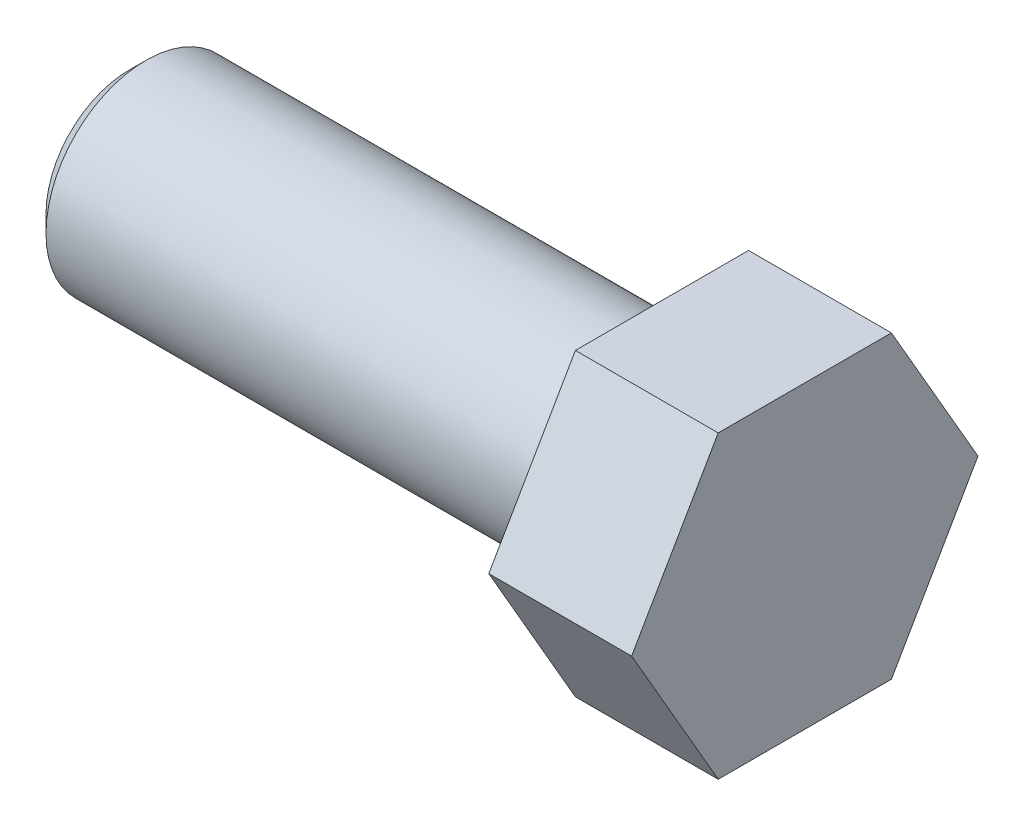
ISO-10303-21;
HEADER;
FILE_DESCRIPTION(('STEP AP214'),'2;1');
FILE_NAME('part.step','',(''),(''),'','','');
FILE_SCHEMA(('AUTOMOTIVE_DESIGN { 1 0 10303 214 1 1 1 1 }'));
ENDSEC;
DATA;
#1=APPLICATION_CONTEXT('core data for automotive mechanical design processes');
#2=APPLICATION_PROTOCOL_DEFINITION('international standard','automotive_design',2000,#1);
#3=PRODUCT_CONTEXT('',#1,'mechanical');
#4=PRODUCT('Part','Part','',(#3));
#5=PRODUCT_RELATED_PRODUCT_CATEGORY('part','',(#4));
#6=PRODUCT_DEFINITION_FORMATION('','',#4);
#7=PRODUCT_DEFINITION_CONTEXT('part definition',#1,'design');
#8=PRODUCT_DEFINITION('design','',#6,#7);
#9=PRODUCT_DEFINITION_SHAPE('','',#8);
#10=(LENGTH_UNIT() NAMED_UNIT(*) SI_UNIT(.MILLI.,.METRE.));
#11=(NAMED_UNIT(*) PLANE_ANGLE_UNIT() SI_UNIT($,.RADIAN.));
#12=(NAMED_UNIT(*) SI_UNIT($,.STERADIAN.) SOLID_ANGLE_UNIT());
#13=UNCERTAINTY_MEASURE_WITH_UNIT(LENGTH_MEASURE(1.E-05),#10,'distance_accuracy_value','');
#14=(GEOMETRIC_REPRESENTATION_CONTEXT(3) GLOBAL_UNCERTAINTY_ASSIGNED_CONTEXT((#13)) GLOBAL_UNIT_ASSIGNED_CONTEXT((#10,
#11,#12)) REPRESENTATION_CONTEXT('',''));
#15=CARTESIAN_POINT('',(0.,0.,0.));
#16=DIRECTION('',(0.,0.,1.));
#17=DIRECTION('',(1.,0.,0.));
#18=AXIS2_PLACEMENT_3D('',#15,#16,#17);
#19=CARTESIAN_POINT('',(-6.80720000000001,4.7625,0.));
#20=DIRECTION('',(1.,0.,0.));
#21=DIRECTION('',(0.,0.,-1.));
#22=AXIS2_PLACEMENT_3D('',#19,#20,#21);
#23=PLANE('',#22);
#24=CARTESIAN_POINT('',(-6.80720000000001,0.,0.));
#25=DIRECTION('',(-1.,0.,0.));
#26=DIRECTION('',(0.,0.,1.));
#27=AXIS2_PLACEMENT_3D('',#24,#25,#26);
#28=CIRCLE('',#27,4.7625);
#29=CARTESIAN_POINT('',(-6.80720000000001,0.,4.7625));
#30=VERTEX_POINT('',#29);
#31=EDGE_CURVE('E479',#30,#30,#28,.T.);
#32=ORIENTED_EDGE('',*,*,#31,.F.);
#33=EDGE_LOOP('',(#32));
#34=FACE_BOUND('',#33,.T.);
#35=DIRECTION('',(0.,-0.866025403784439,0.5));
#36=VECTOR('',#35,1.);
#37=CARTESIAN_POINT('',(-6.80720000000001,7.14639485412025,4.12902700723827));
#38=LINE('',#37,#36);
#39=CARTESIAN_POINT('',(-6.80720000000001,7.14903970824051,4.12749999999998));
#40=VERTEX_POINT('',#39);
#41=CARTESIAN_POINT('',(-6.80720000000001,0.,8.25499999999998));
#42=VERTEX_POINT('',#41);
#43=EDGE_CURVE('E12',#40,#42,#38,.T.);
#44=ORIENTED_EDGE('',*,*,#43,.F.);
#45=DIRECTION('',(0.,0.,1.));
#46=VECTOR('',#45,1.);
#47=CARTESIAN_POINT('',(-6.80720000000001,7.14903970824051,0.));
#48=LINE('',#47,#46);
#49=CARTESIAN_POINT('',(-6.80720000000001,7.1490397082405,-4.12749999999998));
#50=VERTEX_POINT('',#49);
#51=EDGE_CURVE('E392',#50,#40,#48,.T.);
#52=ORIENTED_EDGE('',*,*,#51,.F.);
#53=DIRECTION('',(0.,0.866025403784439,0.5));
#54=VECTOR('',#53,1.);
#55=CARTESIAN_POINT('',(-6.80720000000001,7.14639485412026,-4.12902700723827));
#56=LINE('',#55,#54);
#57=CARTESIAN_POINT('',(-6.80720000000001,0.,-8.25499999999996));
#58=VERTEX_POINT('',#57);
#59=EDGE_CURVE('E487',#58,#50,#56,.T.);
#60=ORIENTED_EDGE('',*,*,#59,.F.);
#61=DIRECTION('',(0.,0.866025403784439,-0.5));
#62=VECTOR('',#61,1.);
#63=CARTESIAN_POINT('',(-6.80720000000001,-0.00264485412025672,-8.25347299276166));
#64=LINE('',#63,#62);
#65=CARTESIAN_POINT('',(-6.80720000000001,-7.14903970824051,-4.12749999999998));
#66=VERTEX_POINT('',#65);
#67=EDGE_CURVE('E485',#66,#58,#64,.T.);
#68=ORIENTED_EDGE('',*,*,#67,.F.);
#69=DIRECTION('',(0.,0.,-1.));
#70=VECTOR('',#69,1.);
#71=CARTESIAN_POINT('',(-6.80720000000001,-7.1490397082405,0.));
#72=LINE('',#71,#70);
#73=CARTESIAN_POINT('',(-6.80720000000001,-7.1490397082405,4.12749999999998));
#74=VERTEX_POINT('',#73);
#75=EDGE_CURVE('E439',#74,#66,#72,.T.);
#76=ORIENTED_EDGE('',*,*,#75,.F.);
#77=DIRECTION('',(0.,-0.866025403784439,-0.5));
#78=VECTOR('',#77,1.);
#79=CARTESIAN_POINT('',(-6.80720000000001,-0.00264485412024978,8.25347299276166));
#80=LINE('',#79,#78);
#81=EDGE_CURVE('E482',#42,#74,#80,.T.);
#82=ORIENTED_EDGE('',*,*,#81,.F.);
#83=EDGE_LOOP('',(#44,#52,#60,#68,#76,#82));
#84=FACE_BOUND('',#83,.T.);
#85=ADVANCED_FACE('F384',(#34,#84),#23,.F.);
#86=CARTESIAN_POINT('',(-32.2072,0.,0.));
#87=DIRECTION('',(-1.,0.,0.));
#88=DIRECTION('',(0.,0.,1.));
#89=AXIS2_PLACEMENT_3D('',#86,#87,#88);
#90=CYLINDRICAL_SURFACE('',#89,4.76249999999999);
#91=CARTESIAN_POINT('',(-31.4039344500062,0.,0.));
#92=DIRECTION('',(-1.,0.,0.));
#93=DIRECTION('',(0.,0.,1.));
#94=AXIS2_PLACEMENT_3D('',#91,#92,#93);
#95=CIRCLE('',#94,4.76249999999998);
#96=CARTESIAN_POINT('',(-31.4039344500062,0.,4.76249999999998));
#97=VERTEX_POINT('',#96);
#98=EDGE_CURVE('E476',#97,#97,#95,.T.);
#99=ORIENTED_EDGE('',*,*,#98,.F.);
#100=EDGE_LOOP('',(#99));
#101=FACE_BOUND('',#100,.T.);
#102=ORIENTED_EDGE('',*,*,#31,.T.);
#103=EDGE_LOOP('',(#102));
#104=FACE_BOUND('',#103,.T.);
#105=ADVANCED_FACE('F513',(#101,#104),#90,.T.);
#106=CARTESIAN_POINT('',(-31.4039344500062,0.,0.));
#107=DIRECTION('',(1.,0.,0.));
#108=DIRECTION('',(0.,0.,-1.));
#109=AXIS2_PLACEMENT_3D('',#106,#107,#108);
#110=CONICAL_SURFACE('',#109,4.76249999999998,0.785398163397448);
#111=CARTESIAN_POINT('',(-32.2072,0.,0.));
#112=DIRECTION('',(-1.,0.,0.));
#113=DIRECTION('',(0.,0.,1.));
#114=AXIS2_PLACEMENT_3D('',#111,#112,#113);
#115=CIRCLE('',#114,3.95923445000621);
#116=CARTESIAN_POINT('',(-32.2072,0.,3.95923445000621));
#117=VERTEX_POINT('',#116);
#118=EDGE_CURVE('E468',#117,#117,#115,.T.);
#119=ORIENTED_EDGE('',*,*,#118,.F.);
#120=EDGE_LOOP('',(#119));
#121=FACE_BOUND('',#120,.T.);
#122=ORIENTED_EDGE('',*,*,#98,.T.);
#123=EDGE_LOOP('',(#122));
#124=FACE_BOUND('',#123,.T.);
#125=ADVANCED_FACE('F518',(#121,#124),#110,.T.);
#126=CARTESIAN_POINT('',(-32.2072,0.,0.));
#127=DIRECTION('',(1.,0.,0.));
#128=DIRECTION('',(0.,0.,-1.));
#129=AXIS2_PLACEMENT_3D('',#126,#127,#128);
#130=PLANE('',#129);
#131=ORIENTED_EDGE('',*,*,#118,.T.);
#132=EDGE_LOOP('',(#131));
#133=FACE_BOUND('',#132,.T.);
#134=ADVANCED_FACE('F525',(#133),#130,.F.);
#135=CARTESIAN_POINT('',(-32.2072,7.14903970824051,4.12749999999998));
#136=DIRECTION('',(0.,0.5,0.866025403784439));
#137=DIRECTION('',(0.,-0.866025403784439,0.5));
#138=AXIS2_PLACEMENT_3D('',#135,#136,#137);
#139=PLANE('',#138);
#140=ORIENTED_EDGE('',*,*,#43,.T.);
#141=DIRECTION('',(1.,0.,0.));
#142=VECTOR('',#141,1.);
#143=CARTESIAN_POINT('',(-32.2072,0.,8.25499999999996));
#144=LINE('',#143,#142);
#145=CARTESIAN_POINT('',(0.,0.,8.25499999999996));
#146=VERTEX_POINT('',#145);
#147=EDGE_CURVE('E407',#42,#146,#144,.T.);
#148=ORIENTED_EDGE('',*,*,#147,.T.);
#149=DIRECTION('',(0.,-0.866025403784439,0.5));
#150=VECTOR('',#149,1.);
#151=CARTESIAN_POINT('',(0.,7.14903970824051,4.12749999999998));
#152=LINE('',#151,#150);
#153=CARTESIAN_POINT('',(0.,7.14903970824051,4.12749999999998));
#154=VERTEX_POINT('',#153);
#155=EDGE_CURVE('E458',#154,#146,#152,.T.);
#156=ORIENTED_EDGE('',*,*,#155,.F.);
#157=DIRECTION('',(1.,0.,0.));
#158=VECTOR('',#157,1.);
#159=CARTESIAN_POINT('',(-32.2072,7.14903970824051,4.12749999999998));
#160=LINE('',#159,#158);
#161=EDGE_CURVE('E466',#40,#154,#160,.T.);
#162=ORIENTED_EDGE('',*,*,#161,.F.);
#163=EDGE_LOOP('',(#140,#148,#156,#162));
#164=FACE_BOUND('',#163,.T.);
#165=ADVANCED_FACE('F499',(#164),#139,.T.);
#166=CARTESIAN_POINT('',(-32.2072,7.1490397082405,-4.12749999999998));
#167=DIRECTION('',(0.,1.,0.));
#168=DIRECTION('',(0.,0.,1.));
#169=AXIS2_PLACEMENT_3D('',#166,#167,#168);
#170=PLANE('',#169);
#171=ORIENTED_EDGE('',*,*,#51,.T.);
#172=ORIENTED_EDGE('',*,*,#161,.T.);
#173=DIRECTION('',(0.,0.,1.));
#174=VECTOR('',#173,1.);
#175=CARTESIAN_POINT('',(0.,7.1490397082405,-4.12749999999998));
#176=LINE('',#175,#174);
#177=CARTESIAN_POINT('',(0.,7.1490397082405,-4.12749999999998));
#178=VERTEX_POINT('',#177);
#179=EDGE_CURVE('E463',#178,#154,#176,.T.);
#180=ORIENTED_EDGE('',*,*,#179,.F.);
#181=DIRECTION('',(1.,0.,0.));
#182=VECTOR('',#181,1.);
#183=CARTESIAN_POINT('',(-32.2072,7.1490397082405,-4.12749999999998));
#184=LINE('',#183,#182);
#185=EDGE_CURVE('E469',#50,#178,#184,.T.);
#186=ORIENTED_EDGE('',*,*,#185,.F.);
#187=EDGE_LOOP('',(#171,#172,#180,#186));
#188=FACE_BOUND('',#187,.T.);
#189=ADVANCED_FACE('F492',(#188),#170,.T.);
#190=CARTESIAN_POINT('',(-32.2072,0.,-8.25499999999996));
#191=DIRECTION('',(0.,0.5,-0.866025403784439));
#192=DIRECTION('',(0.,0.866025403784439,0.5));
#193=AXIS2_PLACEMENT_3D('',#190,#191,#192);
#194=PLANE('',#193);
#195=ORIENTED_EDGE('',*,*,#59,.T.);
#196=ORIENTED_EDGE('',*,*,#185,.T.);
#197=DIRECTION('',(0.,0.866025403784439,0.5));
#198=VECTOR('',#197,1.);
#199=CARTESIAN_POINT('',(0.,0.,-8.25499999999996));
#200=LINE('',#199,#198);
#201=CARTESIAN_POINT('',(0.,0.,-8.25499999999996));
#202=VERTEX_POINT('',#201);
#203=EDGE_CURVE('E452',#202,#178,#200,.T.);
#204=ORIENTED_EDGE('',*,*,#203,.F.);
#205=DIRECTION('',(1.,0.,0.));
#206=VECTOR('',#205,1.);
#207=CARTESIAN_POINT('',(-32.2072,0.,-8.25499999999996));
#208=LINE('',#207,#206);
#209=EDGE_CURVE('E442',#58,#202,#208,.T.);
#210=ORIENTED_EDGE('',*,*,#209,.F.);
#211=EDGE_LOOP('',(#195,#196,#204,#210));
#212=FACE_BOUND('',#211,.T.);
#213=ADVANCED_FACE('F503',(#212),#194,.T.);
#214=CARTESIAN_POINT('',(-32.2072,-7.14903970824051,-4.12749999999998));
#215=DIRECTION('',(0.,-0.5,-0.866025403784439));
#216=DIRECTION('',(0.,0.866025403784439,-0.5));
#217=AXIS2_PLACEMENT_3D('',#214,#215,#216);
#218=PLANE('',#217);
#219=ORIENTED_EDGE('',*,*,#67,.T.);
#220=ORIENTED_EDGE('',*,*,#209,.T.);
#221=DIRECTION('',(0.,0.866025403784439,-0.5));
#222=VECTOR('',#221,1.);
#223=CARTESIAN_POINT('',(0.,-7.14903970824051,-4.12749999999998));
#224=LINE('',#223,#222);
#225=CARTESIAN_POINT('',(0.,-7.14903970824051,-4.12749999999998));
#226=VERTEX_POINT('',#225);
#227=EDGE_CURVE('E446',#226,#202,#224,.T.);
#228=ORIENTED_EDGE('',*,*,#227,.F.);
#229=DIRECTION('',(1.,0.,0.));
#230=VECTOR('',#229,1.);
#231=CARTESIAN_POINT('',(-32.2072,-7.14903970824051,-4.12749999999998));
#232=LINE('',#231,#230);
#233=EDGE_CURVE('E435',#66,#226,#232,.T.);
#234=ORIENTED_EDGE('',*,*,#233,.F.);
#235=EDGE_LOOP('',(#219,#220,#228,#234));
#236=FACE_BOUND('',#235,.T.);
#237=ADVANCED_FACE('F447',(#236),#218,.T.);
#238=CARTESIAN_POINT('',(-32.2072,-7.1490397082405,4.12749999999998));
#239=DIRECTION('',(0.,-1.,0.));
#240=DIRECTION('',(0.,0.,-1.));
#241=AXIS2_PLACEMENT_3D('',#238,#239,#240);
#242=PLANE('',#241);
#243=ORIENTED_EDGE('',*,*,#75,.T.);
#244=ORIENTED_EDGE('',*,*,#233,.T.);
#245=DIRECTION('',(0.,0.,-1.));
#246=VECTOR('',#245,1.);
#247=CARTESIAN_POINT('',(0.,-7.1490397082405,4.12749999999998));
#248=LINE('',#247,#246);
#249=CARTESIAN_POINT('',(0.,-7.14903970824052,4.12749999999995));
#250=VERTEX_POINT('',#249);
#251=EDGE_CURVE('E399',#250,#226,#248,.T.);
#252=ORIENTED_EDGE('',*,*,#251,.F.);
#253=DIRECTION('',(1.,0.,0.));
#254=VECTOR('',#253,1.);
#255=CARTESIAN_POINT('',(-32.2072,-7.1490397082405,4.12749999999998));
#256=LINE('',#255,#254);
#257=EDGE_CURVE('E443',#74,#250,#256,.T.);
#258=ORIENTED_EDGE('',*,*,#257,.F.);
#259=EDGE_LOOP('',(#243,#244,#252,#258));
#260=FACE_BOUND('',#259,.T.);
#261=ADVANCED_FACE('F437',(#260),#242,.T.);
#262=CARTESIAN_POINT('',(-32.2072,0.,8.25499999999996));
#263=DIRECTION('',(0.,-0.5,0.866025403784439));
#264=DIRECTION('',(0.,-0.866025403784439,-0.5));
#265=AXIS2_PLACEMENT_3D('',#262,#263,#264);
#266=PLANE('',#265);
#267=ORIENTED_EDGE('',*,*,#81,.T.);
#268=ORIENTED_EDGE('',*,*,#257,.T.);
#269=DIRECTION('',(0.,-0.866025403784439,-0.5));
#270=VECTOR('',#269,1.);
#271=CARTESIAN_POINT('',(0.,0.,8.25499999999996));
#272=LINE('',#271,#270);
#273=EDGE_CURVE('E456',#146,#250,#272,.T.);
#274=ORIENTED_EDGE('',*,*,#273,.F.);
#275=ORIENTED_EDGE('',*,*,#147,.F.);
#276=EDGE_LOOP('',(#267,#268,#274,#275));
#277=FACE_BOUND('',#276,.T.);
#278=ADVANCED_FACE('F501',(#277),#266,.T.);
#279=CARTESIAN_POINT('',(0.,0.,0.));
#280=DIRECTION('',(-1.,0.,0.));
#281=DIRECTION('',(0.,0.,1.));
#282=AXIS2_PLACEMENT_3D('',#279,#280,#281);
#283=PLANE('',#282);
#284=ORIENTED_EDGE('',*,*,#155,.T.);
#285=ORIENTED_EDGE('',*,*,#273,.T.);
#286=ORIENTED_EDGE('',*,*,#251,.T.);
#287=ORIENTED_EDGE('',*,*,#227,.T.);
#288=ORIENTED_EDGE('',*,*,#203,.T.);
#289=ORIENTED_EDGE('',*,*,#179,.T.);
#290=EDGE_LOOP('',(#284,#285,#286,#287,#288,#289));
#291=FACE_BOUND('',#290,.T.);
#292=ADVANCED_FACE('F386',(#291),#283,.F.);
#293=CLOSED_SHELL('',(#85,#105,#125,#134,#165,#189,#213,#237,#261,#278,#292));
#294=MANIFOLD_SOLID_BREP('B2',#293);
#295=ADVANCED_BREP_SHAPE_REPRESENTATION('',(#18,#294),#14);
#296=SHAPE_DEFINITION_REPRESENTATION(#9,#295);
ENDSEC;
END-ISO-10303-21;
